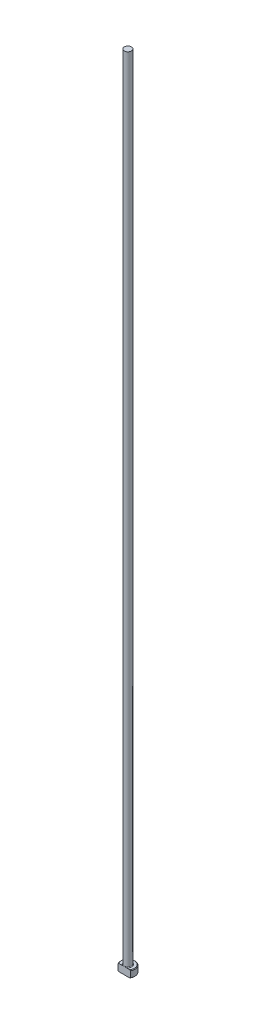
from build123d import *

# Parameters (mm, degrees)
CHAMFER1_SIZE = 0.254
FILLET1_R     = 0.254
KEY_DEPTH     = 356.628347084


with BuildPart() as part:
    # Sketch1 → Revolve1 (revolve)
    with BuildSketch(Plane.XY, mode=Mode.PRIVATE) as revolve1_sk:
        Polygon((0, 0), (-3.175, 0), (-3.175, 3.175), (-1.5875, 3.175), (-1.5875, 355.6), (0, 355.6), align=None)
    revolve(revolve1_sk.sketch.rotate(Axis((0, 259.958771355, 0), (0, -1, 0)), 270), axis=Axis((0, 259.958771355, 0), (0, -1, 0)))

    # Chamfer1
    chamfer1_edges = [part.edges().sort_by_distance(p)[0] for p in [
        (0, 3.175, -3.175),
        (0, 0, -3.175),
    ]]
    chamfer(chamfer1_edges, length=CHAMFER1_SIZE)

    # Fillet1
    fillet1_edges = [part.edges().sort_by_distance(p)[0] for p in [
        (0, 3.175, -1.5875),
    ]]
    fillet(fillet1_edges, radius=FILLET1_R)

    # Sketch2 → Key (cut, through all)
    with BuildSketch(Plane(origin=(0, 0, 0), x_dir=(1, 0, 0), z_dir=(0, 1, 0))):
        with BuildLine():
            Line((-2.749630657, -1.5875), (2.749630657, -1.5875))
            ThreePointArc((2.749630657, -1.5875), (0, -3.175), (-2.749630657, -1.5875))
        make_face()
    extrude(amount=KEY_DEPTH, mode=Mode.SUBTRACT)


solid = part.part
